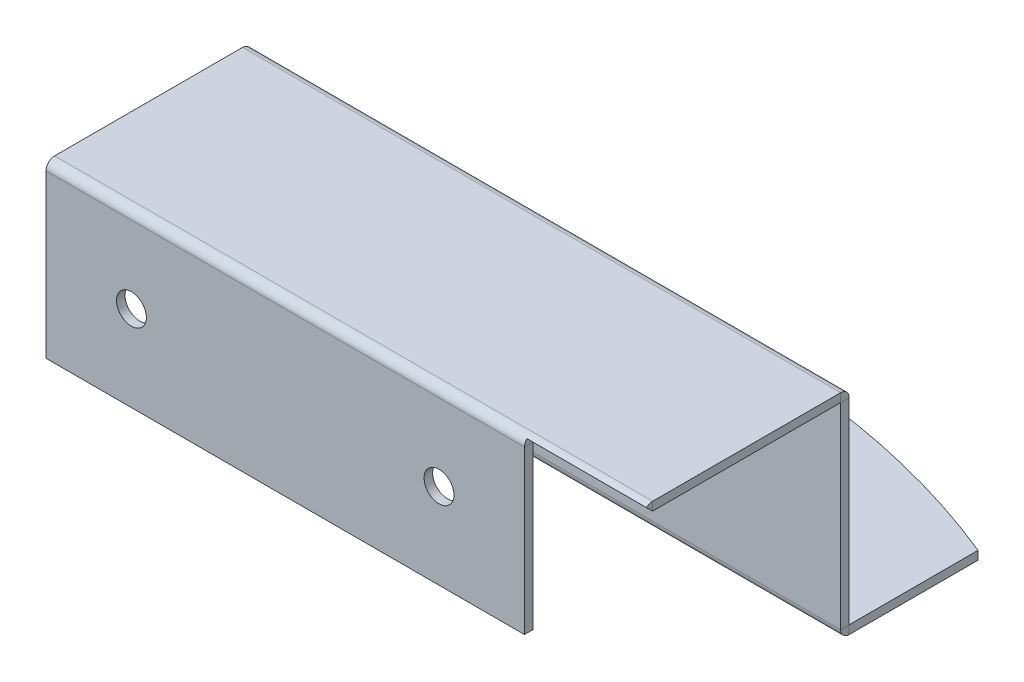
ISO-10303-21;
HEADER;
FILE_DESCRIPTION(('STEP AP214'),'2;1');
FILE_NAME('part.step','',(''),(''),'','','');
FILE_SCHEMA(('AUTOMOTIVE_DESIGN { 1 0 10303 214 1 1 1 1 }'));
ENDSEC;
DATA;
#1=APPLICATION_CONTEXT('core data for automotive mechanical design processes');
#2=APPLICATION_PROTOCOL_DEFINITION('international standard','automotive_design',2000,#1);
#3=PRODUCT_CONTEXT('',#1,'mechanical');
#4=PRODUCT('Part','Part','',(#3));
#5=PRODUCT_RELATED_PRODUCT_CATEGORY('part','',(#4));
#6=PRODUCT_DEFINITION_FORMATION('','',#4);
#7=PRODUCT_DEFINITION_CONTEXT('part definition',#1,'design');
#8=PRODUCT_DEFINITION('design','',#6,#7);
#9=PRODUCT_DEFINITION_SHAPE('','',#8);
#10=(LENGTH_UNIT() NAMED_UNIT(*) SI_UNIT(.MILLI.,.METRE.));
#11=(NAMED_UNIT(*) PLANE_ANGLE_UNIT() SI_UNIT($,.RADIAN.));
#12=(NAMED_UNIT(*) SI_UNIT($,.STERADIAN.) SOLID_ANGLE_UNIT());
#13=UNCERTAINTY_MEASURE_WITH_UNIT(LENGTH_MEASURE(1.E-05),#10,'distance_accuracy_value','');
#14=(GEOMETRIC_REPRESENTATION_CONTEXT(3) GLOBAL_UNCERTAINTY_ASSIGNED_CONTEXT((#13)) GLOBAL_UNIT_ASSIGNED_CONTEXT((#10,
#11,#12)) REPRESENTATION_CONTEXT('',''));
#15=CARTESIAN_POINT('',(0.,0.,0.));
#16=DIRECTION('',(0.,0.,1.));
#17=DIRECTION('',(1.,0.,0.));
#18=AXIS2_PLACEMENT_3D('',#15,#16,#17);
#19=CARTESIAN_POINT('',(0.,69.02,-70.0100000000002));
#20=DIRECTION('',(0.,0.,-1.));
#21=DIRECTION('',(0.,1.,0.));
#22=AXIS2_PLACEMENT_3D('',#19,#20,#21);
#23=PLANE('',#22);
#24=DIRECTION('',(0.,-1.,0.));
#25=VECTOR('',#24,1.);
#26=CARTESIAN_POINT('',(35.,49.02,-70.0100000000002));
#27=LINE('',#26,#25);
#28=CARTESIAN_POINT('',(35.,24.01,-70.0099999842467));
#29=VERTEX_POINT('',#28);
#30=CARTESIAN_POINT('',(35.,1.,-70.01));
#31=VERTEX_POINT('',#30);
#32=EDGE_CURVE('E52',#29,#31,#27,.T.);
#33=ORIENTED_EDGE('',*,*,#32,.T.);
#34=DIRECTION('',(-1.,0.,0.));
#35=VECTOR('',#34,1.);
#36=CARTESIAN_POINT('',(0.,1.,-70.01));
#37=LINE('',#36,#35);
#38=CARTESIAN_POINT('',(-35.,1.,-70.01));
#39=VERTEX_POINT('',#38);
#40=EDGE_CURVE('E179',#31,#39,#37,.T.);
#41=ORIENTED_EDGE('',*,*,#40,.T.);
#42=DIRECTION('',(0.,1.,0.));
#43=VECTOR('',#42,1.);
#44=CARTESIAN_POINT('',(-35.,69.02,-70.0100000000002));
#45=LINE('',#44,#43);
#46=CARTESIAN_POINT('',(-35.,24.01,-70.0099999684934));
#47=VERTEX_POINT('',#46);
#48=EDGE_CURVE('E240',#39,#47,#45,.T.);
#49=ORIENTED_EDGE('',*,*,#48,.T.);
#50=DIRECTION('',(-1.,0.,0.));
#51=VECTOR('',#50,1.);
#52=CARTESIAN_POINT('',(0.,24.01,-70.0100000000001));
#53=LINE('',#52,#51);
#54=EDGE_CURVE('E231',#29,#47,#53,.T.);
#55=ORIENTED_EDGE('',*,*,#54,.F.);
#56=EDGE_LOOP('',(#33,#41,#49,#55));
#57=FACE_BOUND('',#56,.T.);
#58=ADVANCED_FACE('F48',(#57),#23,.T.);
#59=CARTESIAN_POINT('',(0.,25.02,-26.0000000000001));
#60=DIRECTION('',(0.,1.,0.));
#61=DIRECTION('',(0.,0.,1.));
#62=AXIS2_PLACEMENT_3D('',#59,#60,#61);
#63=PLANE('',#62);
#64=DIRECTION('',(0.,0.,-1.));
#65=VECTOR('',#64,1.);
#66=CARTESIAN_POINT('',(35.,25.02,-46.0000000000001));
#67=LINE('',#66,#65);
#68=CARTESIAN_POINT('',(35.,25.0199999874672,-47.0100000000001));
#69=VERTEX_POINT('',#68);
#70=CARTESIAN_POINT('',(35.,25.0199999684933,-69.0000000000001));
#71=VERTEX_POINT('',#70);
#72=EDGE_CURVE('E340',#69,#71,#67,.T.);
#73=ORIENTED_EDGE('',*,*,#72,.T.);
#74=DIRECTION('',(-1.,0.,0.));
#75=VECTOR('',#74,1.);
#76=CARTESIAN_POINT('',(0.,25.02,-69.0000000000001));
#77=LINE('',#76,#75);
#78=CARTESIAN_POINT('',(-35.,25.02,-69.));
#79=VERTEX_POINT('',#78);
#80=EDGE_CURVE('E326',#71,#79,#77,.T.);
#81=ORIENTED_EDGE('',*,*,#80,.T.);
#82=DIRECTION('',(0.,0.,1.));
#83=VECTOR('',#82,1.);
#84=CARTESIAN_POINT('',(-35.,25.02,-26.0000000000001));
#85=LINE('',#84,#83);
#86=CARTESIAN_POINT('',(-35.,25.0199999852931,-47.0100000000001));
#87=VERTEX_POINT('',#86);
#88=EDGE_CURVE('E317',#79,#87,#85,.T.);
#89=ORIENTED_EDGE('',*,*,#88,.T.);
#90=DIRECTION('',(-1.,0.,0.));
#91=VECTOR('',#90,1.);
#92=CARTESIAN_POINT('',(0.,25.02,-47.0100000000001));
#93=LINE('',#92,#91);
#94=EDGE_CURVE('E314',#69,#87,#93,.T.);
#95=ORIENTED_EDGE('',*,*,#94,.F.);
#96=EDGE_LOOP('',(#73,#81,#89,#95));
#97=FACE_BOUND('',#96,.T.);
#98=ADVANCED_FACE('F384',(#97),#63,.T.);
#99=CARTESIAN_POINT('',(-35.,25.02,-26.0000000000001));
#100=DIRECTION('',(1.,0.,0.));
#101=DIRECTION('',(0.,0.,-1.));
#102=AXIS2_PLACEMENT_3D('',#99,#100,#101);
#103=PLANE('',#102);
#104=DIRECTION('',(0.,1.,0.));
#105=VECTOR('',#104,1.);
#106=CARTESIAN_POINT('',(-35.,25.02,-69.0000000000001));
#107=LINE('',#106,#105);
#108=CARTESIAN_POINT('',(-35.,24.0199999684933,-69.0000000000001));
#109=VERTEX_POINT('',#108);
#110=EDGE_CURVE('E333',#109,#79,#107,.T.);
#111=ORIENTED_EDGE('',*,*,#110,.F.);
#112=DIRECTION('',(0.,0.,1.));
#113=VECTOR('',#112,1.);
#114=CARTESIAN_POINT('',(-35.,24.02,-26.0000000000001));
#115=LINE('',#114,#113);
#116=CARTESIAN_POINT('',(-35.,24.0199999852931,-47.0100000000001));
#117=VERTEX_POINT('',#116);
#118=EDGE_CURVE('E337',#109,#117,#115,.T.);
#119=ORIENTED_EDGE('',*,*,#118,.T.);
#120=DIRECTION('',(0.,1.,0.));
#121=VECTOR('',#120,1.);
#122=CARTESIAN_POINT('',(-35.,25.02,-47.0100000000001));
#123=LINE('',#122,#121);
#124=EDGE_CURVE('E316',#117,#87,#123,.T.);
#125=ORIENTED_EDGE('',*,*,#124,.T.);
#126=ORIENTED_EDGE('',*,*,#88,.F.);
#127=EDGE_LOOP('',(#111,#119,#125,#126));
#128=FACE_BOUND('',#127,.T.);
#129=ADVANCED_FACE('F389',(#128),#103,.F.);
#130=CARTESIAN_POINT('',(35.,25.02,-46.0000000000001));
#131=DIRECTION('',(-1.,0.,0.));
#132=DIRECTION('',(0.,0.,1.));
#133=AXIS2_PLACEMENT_3D('',#130,#131,#132);
#134=PLANE('',#133);
#135=DIRECTION('',(0.,-1.,0.));
#136=VECTOR('',#135,1.);
#137=CARTESIAN_POINT('',(35.,25.02,-69.0000000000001));
#138=LINE('',#137,#136);
#139=CARTESIAN_POINT('',(35.,24.0199999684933,-69.0000000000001));
#140=VERTEX_POINT('',#139);
#141=EDGE_CURVE('E329',#71,#140,#138,.T.);
#142=ORIENTED_EDGE('',*,*,#141,.F.);
#143=ORIENTED_EDGE('',*,*,#72,.F.);
#144=DIRECTION('',(0.,-1.,0.));
#145=VECTOR('',#144,1.);
#146=CARTESIAN_POINT('',(35.,25.02,-47.0100000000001));
#147=LINE('',#146,#145);
#148=CARTESIAN_POINT('',(35.,24.02,-47.0100000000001));
#149=VERTEX_POINT('',#148);
#150=EDGE_CURVE('E323',#69,#149,#147,.T.);
#151=ORIENTED_EDGE('',*,*,#150,.T.);
#152=DIRECTION('',(0.,0.,-1.));
#153=VECTOR('',#152,1.);
#154=CARTESIAN_POINT('',(35.,24.02,-46.0000000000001));
#155=LINE('',#154,#153);
#156=EDGE_CURVE('E313',#149,#140,#155,.T.);
#157=ORIENTED_EDGE('',*,*,#156,.T.);
#158=EDGE_LOOP('',(#142,#143,#151,#157));
#159=FACE_BOUND('',#158,.T.);
#160=ADVANCED_FACE('F449',(#159),#134,.F.);
#161=CARTESIAN_POINT('',(0.,24.02,-26.0000000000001));
#162=DIRECTION('',(0.,1.,0.));
#163=DIRECTION('',(0.,0.,1.));
#164=AXIS2_PLACEMENT_3D('',#161,#162,#163);
#165=PLANE('',#164);
#166=DIRECTION('',(-1.,0.,0.));
#167=VECTOR('',#166,1.);
#168=CARTESIAN_POINT('',(0.,24.02,-69.0000000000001));
#169=LINE('',#168,#167);
#170=EDGE_CURVE('E331',#140,#109,#169,.T.);
#171=ORIENTED_EDGE('',*,*,#170,.F.);
#172=ORIENTED_EDGE('',*,*,#156,.F.);
#173=DIRECTION('',(-1.,0.,0.));
#174=VECTOR('',#173,1.);
#175=CARTESIAN_POINT('',(0.,24.02,-47.0100000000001));
#176=LINE('',#175,#174);
#177=EDGE_CURVE('E320',#149,#117,#176,.T.);
#178=ORIENTED_EDGE('',*,*,#177,.T.);
#179=ORIENTED_EDGE('',*,*,#118,.F.);
#180=EDGE_LOOP('',(#171,#172,#178,#179));
#181=FACE_BOUND('',#180,.T.);
#182=ADVANCED_FACE('F455',(#181),#165,.F.);
#183=CARTESIAN_POINT('',(21.,24.0100000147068,-47.0100000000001));
#184=DIRECTION('',(1.,0.,0.));
#185=DIRECTION('',(0.,0.,-1.));
#186=AXIS2_PLACEMENT_3D('',#183,#184,#185);
#187=PLANE('',#186);
#188=DIRECTION('',(0.,0.,-1.));
#189=VECTOR('',#188,1.);
#190=CARTESIAN_POINT('',(21.,24.01,-46.0000000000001));
#191=LINE('',#190,#189);
#192=CARTESIAN_POINT('',(21.,24.01,-46.0000000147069));
#193=VERTEX_POINT('',#192);
#194=CARTESIAN_POINT('',(21.,24.01,-47.0000000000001));
#195=VERTEX_POINT('',#194);
#196=EDGE_CURVE('E235',#193,#195,#191,.T.);
#197=ORIENTED_EDGE('',*,*,#196,.T.);
#198=CARTESIAN_POINT('',(21.,24.01,-47.0100000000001));
#199=DIRECTION('',(1.,0.,0.));
#200=DIRECTION('',(0.,0.,-1.));
#201=AXIS2_PLACEMENT_3D('',#198,#199,#200);
#202=CIRCLE('',#201,0.00999998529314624);
#203=CARTESIAN_POINT('',(21.,24.0170433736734,-47.0029013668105));
#204=VERTEX_POINT('',#203);
#205=EDGE_CURVE('E245',#195,#204,#202,.F.);
#206=ORIENTED_EDGE('',*,*,#205,.T.);
#207=DIRECTION('',(0.,0.704338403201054,0.709864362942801));
#208=VECTOR('',#207,1.);
#209=CARTESIAN_POINT('',(21.,24.7213817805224,-46.2930370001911));
#210=LINE('',#209,#208);
#211=CARTESIAN_POINT('',(21.,24.7213817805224,-46.2930370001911));
#212=VERTEX_POINT('',#211);
#213=EDGE_CURVE('E311',#204,#212,#210,.T.);
#214=ORIENTED_EDGE('',*,*,#213,.T.);
#215=CARTESIAN_POINT('',(21.,24.0100000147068,-47.0100000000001));
#216=DIRECTION('',(-1.,0.,0.));
#217=DIRECTION('',(0.,0.,1.));
#218=AXIS2_PLACEMENT_3D('',#215,#216,#217);
#219=CIRCLE('',#218,1.00999998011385);
#220=EDGE_CURVE('E297',#193,#212,#219,.T.);
#221=ORIENTED_EDGE('',*,*,#220,.F.);
#222=EDGE_LOOP('',(#197,#206,#214,#221));
#223=FACE_BOUND('',#222,.T.);
#224=ADVANCED_FACE('F436',(#223),#187,.T.);
#225=CARTESIAN_POINT('',(28.,24.7213817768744,-46.2930370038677));
#226=DIRECTION('',(0.,-0.709864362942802,0.704338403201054));
#227=DIRECTION('',(1.,0.,0.));
#228=AXIS2_PLACEMENT_3D('',#225,#226,#227);
#229=PLANE('',#228);
#230=ORIENTED_EDGE('',*,*,#213,.F.);
#231=DIRECTION('',(1.,0.,0.));
#232=VECTOR('',#231,1.);
#233=CARTESIAN_POINT('',(28.,24.0170433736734,-47.0029013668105));
#234=LINE('',#233,#232);
#235=CARTESIAN_POINT('',(35.,24.0170433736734,-47.0029013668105));
#236=VERTEX_POINT('',#235);
#237=EDGE_CURVE('E290',#204,#236,#234,.T.);
#238=ORIENTED_EDGE('',*,*,#237,.T.);
#239=DIRECTION('',(0.,0.704338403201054,0.709864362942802));
#240=VECTOR('',#239,1.);
#241=CARTESIAN_POINT('',(35.,24.7213817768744,-46.2930370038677));
#242=LINE('',#241,#240);
#243=CARTESIAN_POINT('',(35.,24.7213817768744,-46.2930370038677));
#244=VERTEX_POINT('',#243);
#245=EDGE_CURVE('E309',#236,#244,#242,.T.);
#246=ORIENTED_EDGE('',*,*,#245,.T.);
#247=DIRECTION('',(1.,0.,0.));
#248=VECTOR('',#247,1.);
#249=CARTESIAN_POINT('',(21.,24.7213817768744,-46.2930370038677));
#250=LINE('',#249,#248);
#251=EDGE_CURVE('E300',#212,#244,#250,.T.);
#252=ORIENTED_EDGE('',*,*,#251,.F.);
#253=EDGE_LOOP('',(#230,#238,#246,#252));
#254=FACE_BOUND('',#253,.T.);
#255=ADVANCED_FACE('F461',(#254),#229,.T.);
#256=CARTESIAN_POINT('',(35.,24.0100000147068,-47.0100000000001));
#257=DIRECTION('',(1.,0.,0.));
#258=DIRECTION('',(0.,0.,-1.));
#259=AXIS2_PLACEMENT_3D('',#256,#257,#258);
#260=PLANE('',#259);
#261=ORIENTED_EDGE('',*,*,#245,.F.);
#262=CARTESIAN_POINT('',(35.,24.01,-47.0100000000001));
#263=DIRECTION('',(1.,0.,0.));
#264=DIRECTION('',(0.,0.,-1.));
#265=AXIS2_PLACEMENT_3D('',#262,#263,#264);
#266=CIRCLE('',#265,0.00999998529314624);
#267=EDGE_CURVE('E287',#236,#149,#266,.F.);
#268=ORIENTED_EDGE('',*,*,#267,.T.);
#269=ORIENTED_EDGE('',*,*,#150,.F.);
#270=CARTESIAN_POINT('',(35.,24.0100000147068,-47.0100000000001));
#271=DIRECTION('',(-1.,0.,0.));
#272=DIRECTION('',(0.,0.,1.));
#273=AXIS2_PLACEMENT_3D('',#270,#271,#272);
#274=CIRCLE('',#273,1.00999997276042);
#275=EDGE_CURVE('E303',#244,#69,#274,.T.);
#276=ORIENTED_EDGE('',*,*,#275,.F.);
#277=EDGE_LOOP('',(#261,#268,#269,#276));
#278=FACE_BOUND('',#277,.T.);
#279=ADVANCED_FACE('F466',(#278),#260,.T.);
#280=CARTESIAN_POINT('',(-35.,24.0100000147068,-47.0100000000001));
#281=DIRECTION('',(-1.,0.,0.));
#282=DIRECTION('',(0.,0.,1.));
#283=AXIS2_PLACEMENT_3D('',#280,#281,#282);
#284=PLANE('',#283);
#285=CARTESIAN_POINT('',(-35.,24.01,-47.0100000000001));
#286=DIRECTION('',(1.,0.,0.));
#287=DIRECTION('',(0.,0.,-1.));
#288=AXIS2_PLACEMENT_3D('',#285,#286,#287);
#289=CIRCLE('',#288,0.00999998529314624);
#290=CARTESIAN_POINT('',(-35.,24.01,-47.0000000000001));
#291=VERTEX_POINT('',#290);
#292=EDGE_CURVE('E289',#117,#291,#289,.T.);
#293=ORIENTED_EDGE('',*,*,#292,.T.);
#294=DIRECTION('',(0.,0.,1.));
#295=VECTOR('',#294,1.);
#296=CARTESIAN_POINT('',(-35.,24.01,-46.0000000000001));
#297=LINE('',#296,#295);
#298=CARTESIAN_POINT('',(-35.,24.01,-46.0000000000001));
#299=VERTEX_POINT('',#298);
#300=EDGE_CURVE('E279',#291,#299,#297,.T.);
#301=ORIENTED_EDGE('',*,*,#300,.T.);
#302=CARTESIAN_POINT('',(-35.,24.0100000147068,-47.0100000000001));
#303=DIRECTION('',(1.,0.,0.));
#304=DIRECTION('',(0.,0.,-1.));
#305=AXIS2_PLACEMENT_3D('',#302,#303,#304);
#306=CIRCLE('',#305,1.00999997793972);
#307=EDGE_CURVE('E306',#87,#299,#306,.T.);
#308=ORIENTED_EDGE('',*,*,#307,.F.);
#309=ORIENTED_EDGE('',*,*,#124,.F.);
#310=EDGE_LOOP('',(#293,#301,#308,#309));
#311=FACE_BOUND('',#310,.T.);
#312=ADVANCED_FACE('F420',(#311),#284,.T.);
#313=CARTESIAN_POINT('',(-70.0359914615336,24.01,-47.0100000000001));
#314=DIRECTION('',(1.,0.,0.));
#315=DIRECTION('',(0.,0.,-1.));
#316=AXIS2_PLACEMENT_3D('',#313,#314,#315);
#317=CYLINDRICAL_SURFACE('',#316,1.00999998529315);
#318=ORIENTED_EDGE('',*,*,#94,.T.);
#319=ORIENTED_EDGE('',*,*,#307,.T.);
#320=DIRECTION('',(-1.,0.,0.));
#321=VECTOR('',#320,1.);
#322=CARTESIAN_POINT('',(0.,24.01,-46.0000000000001));
#323=LINE('',#322,#321);
#324=EDGE_CURVE('E262',#193,#299,#323,.T.);
#325=ORIENTED_EDGE('',*,*,#324,.F.);
#326=ORIENTED_EDGE('',*,*,#220,.T.);
#327=ORIENTED_EDGE('',*,*,#251,.T.);
#328=ORIENTED_EDGE('',*,*,#275,.T.);
#329=EDGE_LOOP('',(#318,#319,#325,#326,#327,#328));
#330=FACE_BOUND('',#329,.T.);
#331=ADVANCED_FACE('F445',(#330),#317,.T.);
#332=CARTESIAN_POINT('',(-70.0359914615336,24.01,-47.0100000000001));
#333=DIRECTION('',(1.,0.,0.));
#334=DIRECTION('',(0.,0.,-1.));
#335=AXIS2_PLACEMENT_3D('',#332,#333,#334);
#336=CYLINDRICAL_SURFACE('',#335,0.00999998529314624);
#337=ORIENTED_EDGE('',*,*,#177,.F.);
#338=ORIENTED_EDGE('',*,*,#267,.F.);
#339=ORIENTED_EDGE('',*,*,#237,.F.);
#340=ORIENTED_EDGE('',*,*,#205,.F.);
#341=DIRECTION('',(-1.,0.,0.));
#342=VECTOR('',#341,1.);
#343=CARTESIAN_POINT('',(0.,24.01,-47.0000000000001));
#344=LINE('',#343,#342);
#345=EDGE_CURVE('E282',#195,#291,#344,.T.);
#346=ORIENTED_EDGE('',*,*,#345,.T.);
#347=ORIENTED_EDGE('',*,*,#292,.F.);
#348=EDGE_LOOP('',(#337,#338,#339,#340,#346,#347));
#349=FACE_BOUND('',#348,.T.);
#350=ADVANCED_FACE('F423',(#349),#336,.F.);
#351=CARTESIAN_POINT('',(-35.,5.01,-46.0000000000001));
#352=DIRECTION('',(0.,1.,0.));
#353=DIRECTION('',(-1.,0.,0.));
#354=AXIS2_PLACEMENT_3D('',#351,#352,#353);
#355=PLANE('',#354);
#356=DIRECTION('',(1.,0.,0.));
#357=VECTOR('',#356,1.);
#358=CARTESIAN_POINT('',(-35.,5.01,-47.0000000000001));
#359=LINE('',#358,#357);
#360=CARTESIAN_POINT('',(-35.,5.01,-47.0000000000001));
#361=VERTEX_POINT('',#360);
#362=CARTESIAN_POINT('',(21.,5.01,-47.0000000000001));
#363=VERTEX_POINT('',#362);
#364=EDGE_CURVE('E276',#361,#363,#359,.T.);
#365=ORIENTED_EDGE('',*,*,#364,.T.);
#366=DIRECTION('',(0.,0.,-1.));
#367=VECTOR('',#366,1.);
#368=CARTESIAN_POINT('',(21.,5.00999999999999,-46.0000000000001));
#369=LINE('',#368,#367);
#370=CARTESIAN_POINT('',(21.,5.00999999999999,-46.0000000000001));
#371=VERTEX_POINT('',#370);
#372=EDGE_CURVE('E246',#371,#363,#369,.T.);
#373=ORIENTED_EDGE('',*,*,#372,.F.);
#374=DIRECTION('',(1.,0.,0.));
#375=VECTOR('',#374,1.);
#376=CARTESIAN_POINT('',(-35.,5.01,-46.0000000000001));
#377=LINE('',#376,#375);
#378=CARTESIAN_POINT('',(-35.,5.01,-46.0000000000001));
#379=VERTEX_POINT('',#378);
#380=EDGE_CURVE('E257',#379,#371,#377,.T.);
#381=ORIENTED_EDGE('',*,*,#380,.F.);
#382=DIRECTION('',(0.,0.,-1.));
#383=VECTOR('',#382,1.);
#384=CARTESIAN_POINT('',(-35.,5.01,-46.0000000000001));
#385=LINE('',#384,#383);
#386=EDGE_CURVE('E273',#379,#361,#385,.T.);
#387=ORIENTED_EDGE('',*,*,#386,.T.);
#388=EDGE_LOOP('',(#365,#373,#381,#387));
#389=FACE_BOUND('',#388,.T.);
#390=ADVANCED_FACE('F478',(#389),#355,.F.);
#391=CARTESIAN_POINT('',(11.,15.01,-46.0000000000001));
#392=DIRECTION('',(0.,0.,-1.));
#393=DIRECTION('',(0.,1.,0.));
#394=AXIS2_PLACEMENT_3D('',#391,#392,#393);
#395=CYLINDRICAL_SURFACE('',#394,1.75);
#396=CARTESIAN_POINT('',(11.,15.01,-46.0000000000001));
#397=DIRECTION('',(0.,0.,1.));
#398=DIRECTION('',(0.,-1.,0.));
#399=AXIS2_PLACEMENT_3D('',#396,#397,#398);
#400=CIRCLE('',#399,1.75);
#401=CARTESIAN_POINT('',(11.,13.26,-46.0000000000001));
#402=VERTEX_POINT('',#401);
#403=EDGE_CURVE('E270',#402,#402,#400,.T.);
#404=ORIENTED_EDGE('',*,*,#403,.T.);
#405=EDGE_LOOP('',(#404));
#406=FACE_BOUND('',#405,.T.);
#407=CARTESIAN_POINT('',(11.,15.01,-47.0000000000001));
#408=DIRECTION('',(0.,0.,1.));
#409=DIRECTION('',(0.,-1.,0.));
#410=AXIS2_PLACEMENT_3D('',#407,#408,#409);
#411=CIRCLE('',#410,1.75);
#412=CARTESIAN_POINT('',(11.,13.26,-47.0000000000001));
#413=VERTEX_POINT('',#412);
#414=EDGE_CURVE('E249',#413,#413,#411,.T.);
#415=ORIENTED_EDGE('',*,*,#414,.F.);
#416=EDGE_LOOP('',(#415));
#417=FACE_BOUND('',#416,.T.);
#418=ADVANCED_FACE('F493',(#406,#417),#395,.F.);
#419=CARTESIAN_POINT('',(-25.,15.01,-46.0000000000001));
#420=DIRECTION('',(0.,0.,-1.));
#421=DIRECTION('',(0.,1.,0.));
#422=AXIS2_PLACEMENT_3D('',#419,#420,#421);
#423=CYLINDRICAL_SURFACE('',#422,1.75);
#424=CARTESIAN_POINT('',(-25.,15.01,-46.0000000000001));
#425=DIRECTION('',(0.,0.,1.));
#426=DIRECTION('',(0.,-1.,0.));
#427=AXIS2_PLACEMENT_3D('',#424,#425,#426);
#428=CIRCLE('',#427,1.75);
#429=CARTESIAN_POINT('',(-25.,13.26,-46.0000000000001));
#430=VERTEX_POINT('',#429);
#431=EDGE_CURVE('E267',#430,#430,#428,.T.);
#432=ORIENTED_EDGE('',*,*,#431,.T.);
#433=EDGE_LOOP('',(#432));
#434=FACE_BOUND('',#433,.T.);
#435=CARTESIAN_POINT('',(-25.,15.01,-47.0000000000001));
#436=DIRECTION('',(0.,0.,1.));
#437=DIRECTION('',(0.,-1.,0.));
#438=AXIS2_PLACEMENT_3D('',#435,#436,#437);
#439=CIRCLE('',#438,1.75);
#440=CARTESIAN_POINT('',(-25.,13.26,-47.0000000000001));
#441=VERTEX_POINT('',#440);
#442=EDGE_CURVE('E252',#441,#441,#439,.T.);
#443=ORIENTED_EDGE('',*,*,#442,.F.);
#444=EDGE_LOOP('',(#443));
#445=FACE_BOUND('',#444,.T.);
#446=ADVANCED_FACE('F489',(#434,#445),#423,.F.);
#447=CARTESIAN_POINT('',(0.,5.01,-46.0000000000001));
#448=DIRECTION('',(0.,0.,1.));
#449=DIRECTION('',(0.,-1.,0.));
#450=AXIS2_PLACEMENT_3D('',#447,#448,#449);
#451=PLANE('',#450);
#452=ORIENTED_EDGE('',*,*,#431,.F.);
#453=EDGE_LOOP('',(#452));
#454=FACE_BOUND('',#453,.T.);
#455=ORIENTED_EDGE('',*,*,#403,.F.);
#456=EDGE_LOOP('',(#455));
#457=FACE_BOUND('',#456,.T.);
#458=DIRECTION('',(0.,1.,0.));
#459=VECTOR('',#458,1.);
#460=CARTESIAN_POINT('',(21.,25.01,-46.0000000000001));
#461=LINE('',#460,#459);
#462=EDGE_CURVE('E264',#371,#193,#461,.T.);
#463=ORIENTED_EDGE('',*,*,#462,.T.);
#464=ORIENTED_EDGE('',*,*,#324,.T.);
#465=DIRECTION('',(0.,-1.,0.));
#466=VECTOR('',#465,1.);
#467=CARTESIAN_POINT('',(-35.,5.01,-46.0000000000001));
#468=LINE('',#467,#466);
#469=EDGE_CURVE('E260',#299,#379,#468,.T.);
#470=ORIENTED_EDGE('',*,*,#469,.T.);
#471=ORIENTED_EDGE('',*,*,#380,.T.);
#472=EDGE_LOOP('',(#463,#464,#470,#471));
#473=FACE_BOUND('',#472,.T.);
#474=ADVANCED_FACE('F440',(#454,#457,#473),#451,.T.);
#475=CARTESIAN_POINT('',(-35.,5.01,-46.0000000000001));
#476=DIRECTION('',(1.,0.,0.));
#477=DIRECTION('',(0.,1.,0.));
#478=AXIS2_PLACEMENT_3D('',#475,#476,#477);
#479=PLANE('',#478);
#480=ORIENTED_EDGE('',*,*,#300,.F.);
#481=DIRECTION('',(0.,-1.,0.));
#482=VECTOR('',#481,1.);
#483=CARTESIAN_POINT('',(-35.,5.01,-47.0000000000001));
#484=LINE('',#483,#482);
#485=EDGE_CURVE('E255',#291,#361,#484,.T.);
#486=ORIENTED_EDGE('',*,*,#485,.T.);
#487=ORIENTED_EDGE('',*,*,#386,.F.);
#488=ORIENTED_EDGE('',*,*,#469,.F.);
#489=EDGE_LOOP('',(#480,#486,#487,#488));
#490=FACE_BOUND('',#489,.T.);
#491=ADVANCED_FACE('F483',(#490),#479,.F.);
#492=CARTESIAN_POINT('',(0.,5.01,-47.0000000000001));
#493=DIRECTION('',(0.,0.,1.));
#494=DIRECTION('',(0.,-1.,0.));
#495=AXIS2_PLACEMENT_3D('',#492,#493,#494);
#496=PLANE('',#495);
#497=ORIENTED_EDGE('',*,*,#345,.F.);
#498=DIRECTION('',(0.,1.,0.));
#499=VECTOR('',#498,1.);
#500=CARTESIAN_POINT('',(21.,25.01,-47.0000000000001));
#501=LINE('',#500,#499);
#502=EDGE_CURVE('E243',#363,#195,#501,.T.);
#503=ORIENTED_EDGE('',*,*,#502,.F.);
#504=ORIENTED_EDGE('',*,*,#364,.F.);
#505=ORIENTED_EDGE('',*,*,#485,.F.);
#506=EDGE_LOOP('',(#497,#503,#504,#505));
#507=FACE_BOUND('',#506,.T.);
#508=ORIENTED_EDGE('',*,*,#442,.T.);
#509=EDGE_LOOP('',(#508));
#510=FACE_BOUND('',#509,.T.);
#511=ORIENTED_EDGE('',*,*,#414,.T.);
#512=EDGE_LOOP('',(#511));
#513=FACE_BOUND('',#512,.T.);
#514=ADVANCED_FACE('F430',(#507,#510,#513),#496,.F.);
#515=CARTESIAN_POINT('',(21.,25.01,-46.0000000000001));
#516=DIRECTION('',(-1.,0.,0.));
#517=DIRECTION('',(0.,-1.,0.));
#518=AXIS2_PLACEMENT_3D('',#515,#516,#517);
#519=PLANE('',#518);
#520=ORIENTED_EDGE('',*,*,#196,.F.);
#521=ORIENTED_EDGE('',*,*,#462,.F.);
#522=ORIENTED_EDGE('',*,*,#372,.T.);
#523=ORIENTED_EDGE('',*,*,#502,.T.);
#524=EDGE_LOOP('',(#520,#521,#522,#523));
#525=FACE_BOUND('',#524,.T.);
#526=ADVANCED_FACE('F397',(#525),#519,.F.);
#527=CARTESIAN_POINT('',(35.,49.02,-70.0100000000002));
#528=DIRECTION('',(-1.,0.,0.));
#529=DIRECTION('',(0.,1.,0.));
#530=AXIS2_PLACEMENT_3D('',#527,#528,#529);
#531=PLANE('',#530);
#532=DIRECTION('',(0.,0.,1.));
#533=VECTOR('',#532,1.);
#534=CARTESIAN_POINT('',(35.,1.,-70.01));
#535=LINE('',#534,#533);
#536=CARTESIAN_POINT('',(35.,1.,-69.01));
#537=VERTEX_POINT('',#536);
#538=EDGE_CURVE('E336',#31,#537,#535,.T.);
#539=ORIENTED_EDGE('',*,*,#538,.F.);
#540=ORIENTED_EDGE('',*,*,#32,.F.);
#541=DIRECTION('',(0.,0.,1.));
#542=VECTOR('',#541,1.);
#543=CARTESIAN_POINT('',(35.,24.01,-70.0100000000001));
#544=LINE('',#543,#542);
#545=CARTESIAN_POINT('',(35.,24.01,-69.0100000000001));
#546=VERTEX_POINT('',#545);
#547=EDGE_CURVE('E238',#29,#546,#544,.T.);
#548=ORIENTED_EDGE('',*,*,#547,.T.);
#549=DIRECTION('',(0.,-1.,0.));
#550=VECTOR('',#549,1.);
#551=CARTESIAN_POINT('',(35.,49.02,-69.0100000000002));
#552=LINE('',#551,#550);
#553=EDGE_CURVE('E73',#546,#537,#552,.T.);
#554=ORIENTED_EDGE('',*,*,#553,.T.);
#555=EDGE_LOOP('',(#539,#540,#548,#554));
#556=FACE_BOUND('',#555,.T.);
#557=ADVANCED_FACE('F356',(#556),#531,.F.);
#558=CARTESIAN_POINT('',(0.,69.02,-69.0100000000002));
#559=DIRECTION('',(0.,0.,-1.));
#560=DIRECTION('',(0.,1.,0.));
#561=AXIS2_PLACEMENT_3D('',#558,#559,#560);
#562=PLANE('',#561);
#563=DIRECTION('',(-1.,0.,0.));
#564=VECTOR('',#563,1.);
#565=CARTESIAN_POINT('',(0.,1.,-69.01));
#566=LINE('',#565,#564);
#567=CARTESIAN_POINT('',(-35.,1.00000000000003,-69.01));
#568=VERTEX_POINT('',#567);
#569=EDGE_CURVE('E57',#537,#568,#566,.T.);
#570=ORIENTED_EDGE('',*,*,#569,.F.);
#571=ORIENTED_EDGE('',*,*,#553,.F.);
#572=DIRECTION('',(-1.,0.,0.));
#573=VECTOR('',#572,1.);
#574=CARTESIAN_POINT('',(0.,24.01,-69.0100000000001));
#575=LINE('',#574,#573);
#576=CARTESIAN_POINT('',(-35.,24.01,-69.0099999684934));
#577=VERTEX_POINT('',#576);
#578=EDGE_CURVE('E236',#546,#577,#575,.T.);
#579=ORIENTED_EDGE('',*,*,#578,.T.);
#580=DIRECTION('',(0.,1.,0.));
#581=VECTOR('',#580,1.);
#582=CARTESIAN_POINT('',(-35.,69.02,-69.0100000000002));
#583=LINE('',#582,#581);
#584=EDGE_CURVE('E65',#568,#577,#583,.T.);
#585=ORIENTED_EDGE('',*,*,#584,.F.);
#586=EDGE_LOOP('',(#570,#571,#579,#585));
#587=FACE_BOUND('',#586,.T.);
#588=ADVANCED_FACE('F396',(#587),#562,.F.);
#589=CARTESIAN_POINT('',(-35.,69.02,-70.0100000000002));
#590=DIRECTION('',(1.,0.,0.));
#591=DIRECTION('',(0.,-1.,0.));
#592=AXIS2_PLACEMENT_3D('',#589,#590,#591);
#593=PLANE('',#592);
#594=DIRECTION('',(0.,0.,-1.));
#595=VECTOR('',#594,1.);
#596=CARTESIAN_POINT('',(-35.,1.,-70.01));
#597=LINE('',#596,#595);
#598=EDGE_CURVE('E12',#568,#39,#597,.T.);
#599=ORIENTED_EDGE('',*,*,#598,.F.);
#600=ORIENTED_EDGE('',*,*,#584,.T.);
#601=DIRECTION('',(0.,0.,-1.));
#602=VECTOR('',#601,1.);
#603=CARTESIAN_POINT('',(-35.,24.01,-70.0100000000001));
#604=LINE('',#603,#602);
#605=EDGE_CURVE('E232',#577,#47,#604,.T.);
#606=ORIENTED_EDGE('',*,*,#605,.T.);
#607=ORIENTED_EDGE('',*,*,#48,.F.);
#608=EDGE_LOOP('',(#599,#600,#606,#607));
#609=FACE_BOUND('',#608,.T.);
#610=ADVANCED_FACE('F50',(#609),#593,.F.);
#611=CARTESIAN_POINT('',(35.,24.01,-69.0000000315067));
#612=DIRECTION('',(1.,0.,0.));
#613=DIRECTION('',(0.,-1.,0.));
#614=AXIS2_PLACEMENT_3D('',#611,#612,#613);
#615=PLANE('',#614);
#616=ORIENTED_EDGE('',*,*,#141,.T.);
#617=CARTESIAN_POINT('',(35.,24.01,-69.0000000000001));
#618=DIRECTION('',(1.,0.,0.));
#619=DIRECTION('',(0.,-1.,0.));
#620=AXIS2_PLACEMENT_3D('',#617,#618,#619);
#621=CIRCLE('',#620,0.00999996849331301);
#622=EDGE_CURVE('E221',#140,#546,#621,.F.);
#623=ORIENTED_EDGE('',*,*,#622,.T.);
#624=ORIENTED_EDGE('',*,*,#547,.F.);
#625=CARTESIAN_POINT('',(35.,24.01,-69.0000000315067));
#626=DIRECTION('',(-1.,0.,0.));
#627=DIRECTION('',(0.,1.,0.));
#628=AXIS2_PLACEMENT_3D('',#625,#626,#627);
#629=CIRCLE('',#628,1.00999995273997);
#630=EDGE_CURVE('E226',#71,#29,#629,.T.);
#631=ORIENTED_EDGE('',*,*,#630,.F.);
#632=EDGE_LOOP('',(#616,#623,#624,#631));
#633=FACE_BOUND('',#632,.T.);
#634=ADVANCED_FACE('F402',(#633),#615,.T.);
#635=CARTESIAN_POINT('',(-35.,24.01,-69.0000000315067));
#636=DIRECTION('',(-1.,0.,0.));
#637=DIRECTION('',(0.,1.,0.));
#638=AXIS2_PLACEMENT_3D('',#635,#636,#637);
#639=PLANE('',#638);
#640=CARTESIAN_POINT('',(-35.,24.01,-69.0000000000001));
#641=DIRECTION('',(1.,0.,0.));
#642=DIRECTION('',(0.,-1.,0.));
#643=AXIS2_PLACEMENT_3D('',#640,#641,#642);
#644=CIRCLE('',#643,0.00999996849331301);
#645=EDGE_CURVE('E223',#577,#109,#644,.T.);
#646=ORIENTED_EDGE('',*,*,#645,.T.);
#647=ORIENTED_EDGE('',*,*,#110,.T.);
#648=CARTESIAN_POINT('',(-35.,24.01,-69.0000000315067));
#649=DIRECTION('',(1.,0.,0.));
#650=DIRECTION('',(0.,-1.,0.));
#651=AXIS2_PLACEMENT_3D('',#648,#649,#650);
#652=CIRCLE('',#651,1.00999995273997);
#653=EDGE_CURVE('E229',#47,#79,#652,.T.);
#654=ORIENTED_EDGE('',*,*,#653,.F.);
#655=ORIENTED_EDGE('',*,*,#605,.F.);
#656=EDGE_LOOP('',(#646,#647,#654,#655));
#657=FACE_BOUND('',#656,.T.);
#658=ADVANCED_FACE('F381',(#657),#639,.T.);
#659=CARTESIAN_POINT('',(-70.0359914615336,24.01,-69.0000000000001));
#660=DIRECTION('',(1.,0.,0.));
#661=DIRECTION('',(0.,-1.,0.));
#662=AXIS2_PLACEMENT_3D('',#659,#660,#661);
#663=CYLINDRICAL_SURFACE('',#662,1.00999996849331);
#664=ORIENTED_EDGE('',*,*,#54,.T.);
#665=ORIENTED_EDGE('',*,*,#653,.T.);
#666=ORIENTED_EDGE('',*,*,#80,.F.);
#667=ORIENTED_EDGE('',*,*,#630,.T.);
#668=EDGE_LOOP('',(#664,#665,#666,#667));
#669=FACE_BOUND('',#668,.T.);
#670=ADVANCED_FACE('F378',(#669),#663,.T.);
#671=CARTESIAN_POINT('',(-70.0359914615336,24.01,-69.0000000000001));
#672=DIRECTION('',(1.,0.,0.));
#673=DIRECTION('',(0.,-1.,0.));
#674=AXIS2_PLACEMENT_3D('',#671,#672,#673);
#675=CYLINDRICAL_SURFACE('',#674,0.00999996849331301);
#676=ORIENTED_EDGE('',*,*,#578,.F.);
#677=ORIENTED_EDGE('',*,*,#622,.F.);
#678=ORIENTED_EDGE('',*,*,#170,.T.);
#679=ORIENTED_EDGE('',*,*,#645,.F.);
#680=EDGE_LOOP('',(#676,#677,#678,#679));
#681=FACE_BOUND('',#680,.T.);
#682=ADVANCED_FACE('F371',(#681),#675,.F.);
#683=CARTESIAN_POINT('',(0.,1.,0.));
#684=DIRECTION('',(0.,-1.,0.));
#685=DIRECTION('',(0.,0.,-1.));
#686=AXIS2_PLACEMENT_3D('',#683,#684,#685);
#687=CYLINDRICAL_SURFACE('',#686,92.);
#688=CARTESIAN_POINT('',(0.,0.,0.));
#689=DIRECTION('',(0.,1.,0.));
#690=DIRECTION('',(0.,0.,1.));
#691=AXIS2_PLACEMENT_3D('',#688,#689,#690);
#692=CIRCLE('',#691,92.);
#693=CARTESIAN_POINT('',(35.,0.,-85.0823130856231));
#694=VERTEX_POINT('',#693);
#695=CARTESIAN_POINT('',(-35.,0.,-85.0823130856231));
#696=VERTEX_POINT('',#695);
#697=EDGE_CURVE('E217',#694,#696,#692,.T.);
#698=ORIENTED_EDGE('',*,*,#697,.T.);
#699=DIRECTION('',(0.,-1.,0.));
#700=VECTOR('',#699,1.);
#701=CARTESIAN_POINT('',(-35.,1.,-85.0823130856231));
#702=LINE('',#701,#700);
#703=CARTESIAN_POINT('',(-35.,1.,-85.0823130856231));
#704=VERTEX_POINT('',#703);
#705=EDGE_CURVE('E189',#704,#696,#702,.T.);
#706=ORIENTED_EDGE('',*,*,#705,.F.);
#707=CARTESIAN_POINT('',(0.,1.,0.));
#708=DIRECTION('',(0.,1.,0.));
#709=DIRECTION('',(0.,0.,1.));
#710=AXIS2_PLACEMENT_3D('',#707,#708,#709);
#711=CIRCLE('',#710,92.);
#712=CARTESIAN_POINT('',(35.,1.,-85.0823130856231));
#713=VERTEX_POINT('',#712);
#714=EDGE_CURVE('E210',#713,#704,#711,.T.);
#715=ORIENTED_EDGE('',*,*,#714,.F.);
#716=DIRECTION('',(0.,-1.,0.));
#717=VECTOR('',#716,1.);
#718=CARTESIAN_POINT('',(35.,1.,-85.0823130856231));
#719=LINE('',#718,#717);
#720=EDGE_CURVE('E214',#713,#694,#719,.T.);
#721=ORIENTED_EDGE('',*,*,#720,.T.);
#722=EDGE_LOOP('',(#698,#706,#715,#721));
#723=FACE_BOUND('',#722,.T.);
#724=ADVANCED_FACE('F367',(#723),#687,.T.);
#725=CARTESIAN_POINT('',(0.,1.,0.));
#726=DIRECTION('',(0.,1.,0.));
#727=DIRECTION('',(0.,0.,1.));
#728=AXIS2_PLACEMENT_3D('',#725,#726,#727);
#729=PLANE('',#728);
#730=ORIENTED_EDGE('',*,*,#40,.F.);
#731=DIRECTION('',(0.,0.,-1.));
#732=VECTOR('',#731,1.);
#733=CARTESIAN_POINT('',(35.,1.,-20.));
#734=LINE('',#733,#732);
#735=EDGE_CURVE('E212',#31,#713,#734,.T.);
#736=ORIENTED_EDGE('',*,*,#735,.T.);
#737=ORIENTED_EDGE('',*,*,#714,.T.);
#738=DIRECTION('',(0.,0.,1.));
#739=VECTOR('',#738,1.);
#740=CARTESIAN_POINT('',(-35.,1.,0.));
#741=LINE('',#740,#739);
#742=EDGE_CURVE('E208',#704,#39,#741,.T.);
#743=ORIENTED_EDGE('',*,*,#742,.T.);
#744=EDGE_LOOP('',(#730,#736,#737,#743));
#745=FACE_BOUND('',#744,.T.);
#746=ADVANCED_FACE('F362',(#745),#729,.T.);
#747=CARTESIAN_POINT('',(35.,1.,-20.));
#748=DIRECTION('',(-1.,0.,0.));
#749=DIRECTION('',(0.,0.,1.));
#750=AXIS2_PLACEMENT_3D('',#747,#748,#749);
#751=PLANE('',#750);
#752=ORIENTED_EDGE('',*,*,#735,.F.);
#753=DIRECTION('',(0.,-1.,0.));
#754=VECTOR('',#753,1.);
#755=CARTESIAN_POINT('',(35.,0.999999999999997,-70.01));
#756=LINE('',#755,#754);
#757=CARTESIAN_POINT('',(35.,0.,-70.01));
#758=VERTEX_POINT('',#757);
#759=EDGE_CURVE('E204',#31,#758,#756,.T.);
#760=ORIENTED_EDGE('',*,*,#759,.T.);
#761=DIRECTION('',(0.,0.,-1.));
#762=VECTOR('',#761,1.);
#763=CARTESIAN_POINT('',(35.,0.,-20.));
#764=LINE('',#763,#762);
#765=EDGE_CURVE('E201',#758,#694,#764,.T.);
#766=ORIENTED_EDGE('',*,*,#765,.T.);
#767=ORIENTED_EDGE('',*,*,#720,.F.);
#768=EDGE_LOOP('',(#752,#760,#766,#767));
#769=FACE_BOUND('',#768,.T.);
#770=ADVANCED_FACE('F364',(#769),#751,.F.);
#771=CARTESIAN_POINT('',(0.,0.,0.));
#772=DIRECTION('',(0.,1.,0.));
#773=DIRECTION('',(0.,0.,1.));
#774=AXIS2_PLACEMENT_3D('',#771,#772,#773);
#775=PLANE('',#774);
#776=ORIENTED_EDGE('',*,*,#765,.F.);
#777=DIRECTION('',(-1.,0.,0.));
#778=VECTOR('',#777,1.);
#779=CARTESIAN_POINT('',(0.,0.,-70.01));
#780=LINE('',#779,#778);
#781=CARTESIAN_POINT('',(-35.,0.,-70.01));
#782=VERTEX_POINT('',#781);
#783=EDGE_CURVE('E176',#758,#782,#780,.T.);
#784=ORIENTED_EDGE('',*,*,#783,.T.);
#785=DIRECTION('',(0.,0.,1.));
#786=VECTOR('',#785,1.);
#787=CARTESIAN_POINT('',(-35.,0.,0.));
#788=LINE('',#787,#786);
#789=EDGE_CURVE('E190',#696,#782,#788,.T.);
#790=ORIENTED_EDGE('',*,*,#789,.F.);
#791=ORIENTED_EDGE('',*,*,#697,.F.);
#792=EDGE_LOOP('',(#776,#784,#790,#791));
#793=FACE_BOUND('',#792,.T.);
#794=ADVANCED_FACE('F200',(#793),#775,.F.);
#795=CARTESIAN_POINT('',(-35.,1.,0.));
#796=DIRECTION('',(1.,0.,0.));
#797=DIRECTION('',(0.,0.,-1.));
#798=AXIS2_PLACEMENT_3D('',#795,#796,#797);
#799=PLANE('',#798);
#800=ORIENTED_EDGE('',*,*,#789,.T.);
#801=DIRECTION('',(0.,1.,0.));
#802=VECTOR('',#801,1.);
#803=CARTESIAN_POINT('',(-35.,0.999999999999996,-70.01));
#804=LINE('',#803,#802);
#805=EDGE_CURVE('E183',#782,#39,#804,.T.);
#806=ORIENTED_EDGE('',*,*,#805,.T.);
#807=ORIENTED_EDGE('',*,*,#742,.F.);
#808=ORIENTED_EDGE('',*,*,#705,.T.);
#809=EDGE_LOOP('',(#800,#806,#807,#808));
#810=FACE_BOUND('',#809,.T.);
#811=ADVANCED_FACE('F194',(#810),#799,.F.);
#812=CARTESIAN_POINT('',(-35.,0.999999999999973,-70.01));
#813=DIRECTION('',(-1.,0.,0.));
#814=DIRECTION('',(0.,0.,1.));
#815=AXIS2_PLACEMENT_3D('',#812,#813,#814);
#816=PLANE('',#815);
#817=CARTESIAN_POINT('',(-35.,1.,-70.01));
#818=DIRECTION('',(1.,0.,0.));
#819=DIRECTION('',(0.,0.,-1.));
#820=AXIS2_PLACEMENT_3D('',#817,#818,#819);
#821=CIRCLE('',#820,0.999999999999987);
#822=EDGE_CURVE('E171',#568,#782,#821,.T.);
#823=ORIENTED_EDGE('',*,*,#822,.F.);
#824=ORIENTED_EDGE('',*,*,#598,.T.);
#825=ORIENTED_EDGE('',*,*,#805,.F.);
#826=EDGE_LOOP('',(#823,#824,#825));
#827=FACE_BOUND('',#826,.T.);
#828=ADVANCED_FACE('F185',(#827),#816,.T.);
#829=CARTESIAN_POINT('',(35.,1.,-70.01));
#830=DIRECTION('',(1.,0.,0.));
#831=DIRECTION('',(0.,0.,-1.));
#832=AXIS2_PLACEMENT_3D('',#829,#830,#831);
#833=CYLINDRICAL_SURFACE('',#832,0.999999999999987);
#834=CARTESIAN_POINT('',(35.,1.,-70.01));
#835=DIRECTION('',(1.,0.,0.));
#836=DIRECTION('',(0.,0.,-1.));
#837=AXIS2_PLACEMENT_3D('',#834,#835,#836);
#838=CIRCLE('',#837,0.999999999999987);
#839=EDGE_CURVE('E180',#537,#758,#838,.T.);
#840=ORIENTED_EDGE('',*,*,#839,.F.);
#841=ORIENTED_EDGE('',*,*,#569,.T.);
#842=ORIENTED_EDGE('',*,*,#822,.T.);
#843=ORIENTED_EDGE('',*,*,#783,.F.);
#844=EDGE_LOOP('',(#840,#841,#842,#843));
#845=FACE_BOUND('',#844,.T.);
#846=ADVANCED_FACE('F174',(#845),#833,.T.);
#847=CARTESIAN_POINT('',(35.,1.,-70.01));
#848=DIRECTION('',(1.,0.,0.));
#849=DIRECTION('',(0.,0.,-1.));
#850=AXIS2_PLACEMENT_3D('',#847,#848,#849);
#851=PLANE('',#850);
#852=ORIENTED_EDGE('',*,*,#538,.T.);
#853=ORIENTED_EDGE('',*,*,#839,.T.);
#854=ORIENTED_EDGE('',*,*,#759,.F.);
#855=EDGE_LOOP('',(#852,#853,#854));
#856=FACE_BOUND('',#855,.T.);
#857=ADVANCED_FACE('F358',(#856),#851,.T.);
#858=CLOSED_SHELL('',(#58,#98,#129,#160,#182,#224,#255,#279,#312,#331,#350,#390,#418,#446,#474,
#491,#514,#526,#557,#588,#610,#634,#658,#670,#682,#724,#746,#770,#794,#811,#828,#846,#857));
#859=MANIFOLD_SOLID_BREP('B2',#858);
#860=ADVANCED_BREP_SHAPE_REPRESENTATION('',(#18,#859),#14);
#861=SHAPE_DEFINITION_REPRESENTATION(#9,#860);
ENDSEC;
END-ISO-10303-21;
